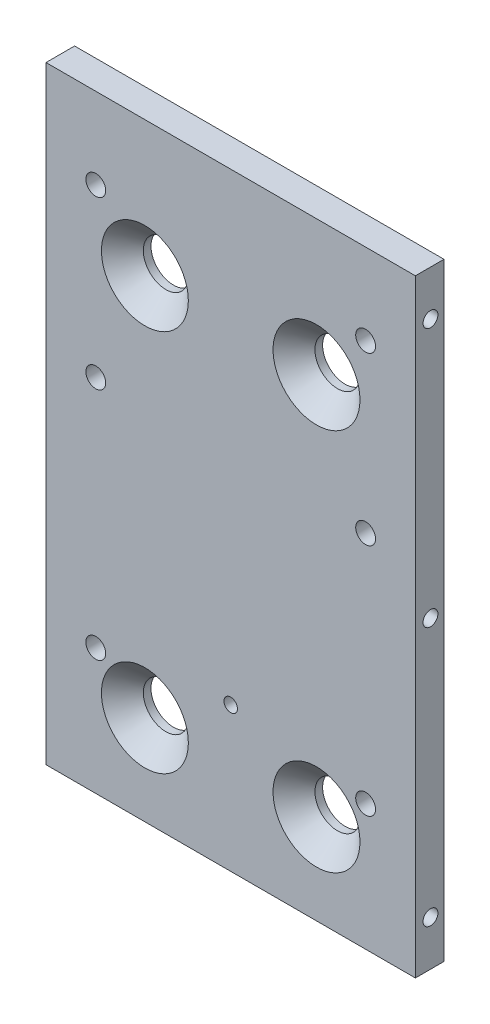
from build123d import *

# Parameters (mm, degrees)
SKETCH1_W                                      = 82
SKETCH1_H                                      = 135
BOSS_EXTRUDE1_DEPTH                            = 6.35
CSK_FOR_M8_FLAT_HEAD_MACHINE_SCREW1_AT_2_COUNT = 2
CSK_FOR_M8_FLAT_HEAD_MACHINE_SCREW1_AT_2_PITCH = 38.1
CSK_FOR_M8_FLAT_HEAD_MACHINE_SCREW1_AT_3_COUNT = 2
CSK_FOR_M8_FLAT_HEAD_MACHINE_SCREW1_AT_3_PITCH = 85
CSK_FOR_M8_FLAT_HEAD_MACHINE_SCREW1_AT_4_COUNT = 2
CSK_FOR_M8_FLAT_HEAD_MACHINE_SCREW1_AT_4_PITCH = 93.148322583
SKETCH9_R                                      = 1.5
CUT_EXTRUDE2_DEPTH                             = 80.231133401
HOLE1_D                                        = 4.4
HOLE1_CBORE_D                                  = 7.5
HOLE1_CBORE_DEPTH                              = 3
SKETCH14_R                                     = 1.65
CUT_EXTRUDE4_DEPTH                             = 15


with BuildPart() as part:
    # Sketch1 → Boss-Extrude1 (new body)
    with BuildSketch(Plane.XY):
        Rectangle(SKETCH1_W, SKETCH1_H)
    extrude(amount=BOSS_EXTRUDE1_DEPTH)

    # Sketch4 → CSK for M8 Flat Head Machine Screw1 (revolve, cut)
    with BuildSketch(Plane(origin=(-19.05, 37.5, 6.35), x_dir=(0, -1, 0), z_dir=(1, 0, 0))):
        Polygon((0, 0), (0, 6.35), (5, 6.35), (5, 4.65), (9.65, 0), align=None)
    csk_for_m8_flat_head_machine_screw1 = revolve(axis=Axis((-19.05, 37.5, 12.7), (0, 0, -1)), mode=Mode.SUBTRACT)

    # CSK for M8 Flat Head Machine Screw1 at 2: CSK for M8 Flat Head Machine Screw1 ×2
    with Locations(*[(i * CSK_FOR_M8_FLAT_HEAD_MACHINE_SCREW1_AT_2_PITCH, 0, 0) for i in range(1, CSK_FOR_M8_FLAT_HEAD_MACHINE_SCREW1_AT_2_COUNT)]):
        add(csk_for_m8_flat_head_machine_screw1, mode=Mode.SUBTRACT)

    # CSK for M8 Flat Head Machine Screw1 at 3: CSK for M8 Flat Head Machine Screw1 ×2
    with Locations(*[(0, -i * CSK_FOR_M8_FLAT_HEAD_MACHINE_SCREW1_AT_3_PITCH, 0) for i in range(1, CSK_FOR_M8_FLAT_HEAD_MACHINE_SCREW1_AT_3_COUNT)]):
        add(csk_for_m8_flat_head_machine_screw1, mode=Mode.SUBTRACT)

    # CSK for M8 Flat Head Machine Screw1 at 4: CSK for M8 Flat Head Machine Screw1 ×2
    with Locations(*[Vector(0.4090250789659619, -0.9125231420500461, 0) * (i * CSK_FOR_M8_FLAT_HEAD_MACHINE_SCREW1_AT_4_PITCH) for i in range(1, CSK_FOR_M8_FLAT_HEAD_MACHINE_SCREW1_AT_4_COUNT)]):
        add(csk_for_m8_flat_head_machine_screw1, mode=Mode.SUBTRACT)

    # Sketch9 → Cut-Extrude2 (cut, through all)
    with BuildSketch(Plane(origin=(0, 0, 0), x_dir=(-1, 0, 0), z_dir=(0, 0, -1))):
        with Locations((0, -35.5)):
            Circle(SKETCH9_R)
    extrude(amount=-CUT_EXTRUDE2_DEPTH, mode=Mode.SUBTRACT)

    # Hole1 (through all)
    with Locations(Plane(origin=(0, 0, 0), x_dir=(-1, 0, 0), z_dir=(0, 0, -1))):
        with Locations((-29.95, -39.5), (-29.95, 12.5), (-29.95, 49.5), (29.95, 49.5), (29.95, 12.5), (29.95, -39.5)):
            CounterBoreHole(HOLE1_D / 2, HOLE1_CBORE_D / 2, HOLE1_CBORE_DEPTH)

    # Sketch14 → Cut-Extrude4 (cut)
    with BuildSketch(Plane(origin=(41, 0, 0), x_dir=(0, 0, -1), z_dir=(1, 0, 0))):
        with Locations(Location((-3, 57.5, 0), (0, 0, 90))):
            Circle(SKETCH14_R)
        with Locations(Location((-3, 0, 0), (0, 0, 90))):
            Circle(SKETCH14_R)
        with Locations(Location((-3, -57.5, 0), (0, 0, 90))):
            Circle(SKETCH14_R)
    cut_extrude4 = extrude(amount=-CUT_EXTRUDE4_DEPTH, mode=Mode.SUBTRACT)

    # Mirror1: Cut-Extrude4 across plane
    add(cut_extrude4.mirror(Plane(origin=(0, 0, 0), x_dir=(0, 0, 1), z_dir=(1, 0, 0))), mode=Mode.SUBTRACT)


solid = part.part
